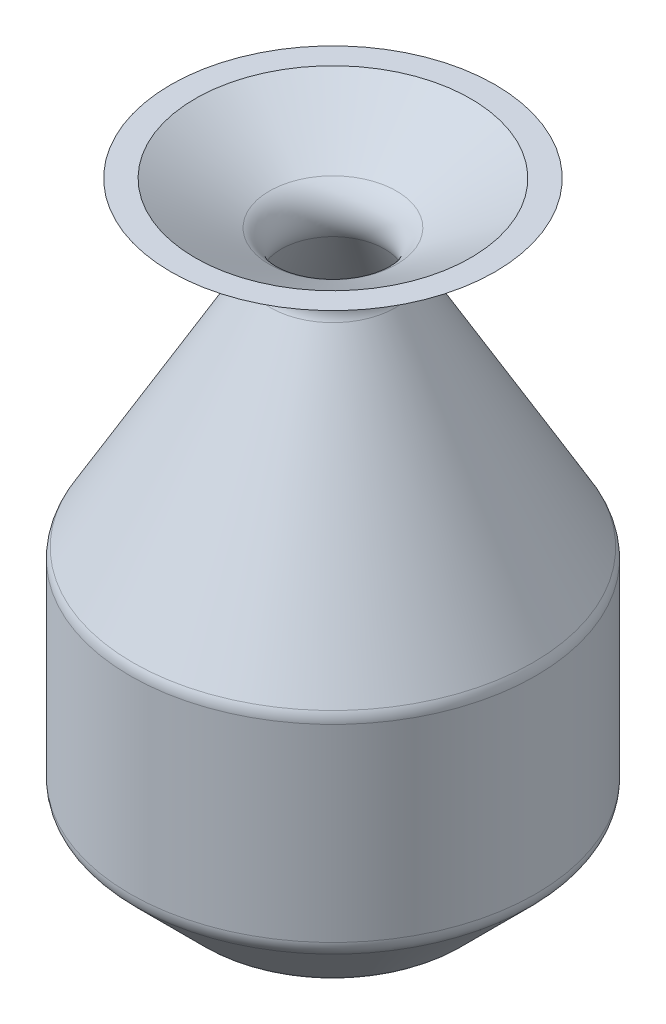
ISO-10303-21;
HEADER;
FILE_DESCRIPTION(('STEP AP214'),'2;1');
FILE_NAME('part.step','',(''),(''),'','','');
FILE_SCHEMA(('AUTOMOTIVE_DESIGN { 1 0 10303 214 1 1 1 1 }'));
ENDSEC;
DATA;
#1=APPLICATION_CONTEXT('core data for automotive mechanical design processes');
#2=APPLICATION_PROTOCOL_DEFINITION('international standard','automotive_design',2000,#1);
#3=PRODUCT_CONTEXT('',#1,'mechanical');
#4=PRODUCT('Part','Part','',(#3));
#5=PRODUCT_RELATED_PRODUCT_CATEGORY('part','',(#4));
#6=PRODUCT_DEFINITION_FORMATION('','',#4);
#7=PRODUCT_DEFINITION_CONTEXT('part definition',#1,'design');
#8=PRODUCT_DEFINITION('design','',#6,#7);
#9=PRODUCT_DEFINITION_SHAPE('','',#8);
#10=(LENGTH_UNIT() NAMED_UNIT(*) SI_UNIT(.MILLI.,.METRE.));
#11=(NAMED_UNIT(*) PLANE_ANGLE_UNIT() SI_UNIT($,.RADIAN.));
#12=(NAMED_UNIT(*) SI_UNIT($,.STERADIAN.) SOLID_ANGLE_UNIT());
#13=UNCERTAINTY_MEASURE_WITH_UNIT(LENGTH_MEASURE(1.E-05),#10,'distance_accuracy_value','');
#14=(GEOMETRIC_REPRESENTATION_CONTEXT(3) GLOBAL_UNCERTAINTY_ASSIGNED_CONTEXT((#13)) GLOBAL_UNIT_ASSIGNED_CONTEXT((#10,
#11,#12)) REPRESENTATION_CONTEXT('',''));
#15=CARTESIAN_POINT('',(0.,0.,0.));
#16=DIRECTION('',(0.,0.,1.));
#17=DIRECTION('',(1.,0.,0.));
#18=AXIS2_PLACEMENT_3D('',#15,#16,#17);
#19=CARTESIAN_POINT('',(0.,0.,0.));
#20=DIRECTION('',(0.,-1.,0.));
#21=DIRECTION('',(0.,0.,-1.));
#22=AXIS2_PLACEMENT_3D('',#19,#20,#21);
#23=PLANE('',#22);
#24=CARTESIAN_POINT('',(0.,0.,0.));
#25=DIRECTION('',(0.,1.,0.));
#26=DIRECTION('',(0.,0.,1.));
#27=AXIS2_PLACEMENT_3D('',#24,#25,#26);
#28=CIRCLE('',#27,27.9289321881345);
#29=CARTESIAN_POINT('',(0.,0.,27.9289321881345));
#30=VERTEX_POINT('',#29);
#31=EDGE_CURVE('E10',#30,#30,#28,.T.);
#32=ORIENTED_EDGE('',*,*,#31,.F.);
#33=EDGE_LOOP('',(#32));
#34=FACE_BOUND('',#33,.T.);
#35=ADVANCED_FACE('F30',(#34),#23,.T.);
#36=CARTESIAN_POINT('',(0.,5.,0.));
#37=DIRECTION('',(0.,1.,0.));
#38=DIRECTION('',(0.,0.,1.));
#39=AXIS2_PLACEMENT_3D('',#36,#37,#38);
#40=TOROIDAL_SURFACE('',#39,27.9289321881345,5.);
#41=ORIENTED_EDGE('',*,*,#31,.T.);
#42=EDGE_LOOP('',(#41));
#43=FACE_BOUND('',#42,.T.);
#44=CARTESIAN_POINT('',(0.,1.46446609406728,0.));
#45=DIRECTION('',(0.,1.,0.));
#46=DIRECTION('',(0.,0.,1.));
#47=AXIS2_PLACEMENT_3D('',#44,#45,#46);
#48=CIRCLE('',#47,31.4644660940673);
#49=CARTESIAN_POINT('',(0.,1.46446609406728,31.4644660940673));
#50=VERTEX_POINT('',#49);
#51=EDGE_CURVE('E36',#50,#50,#48,.T.);
#52=ORIENTED_EDGE('',*,*,#51,.F.);
#53=EDGE_LOOP('',(#52));
#54=FACE_BOUND('',#53,.T.);
#55=ADVANCED_FACE('F160',(#43,#54),#40,.T.);
#56=CARTESIAN_POINT('',(0.,18.5355339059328,0.));
#57=DIRECTION('',(0.,1.,0.));
#58=DIRECTION('',(0.,0.,1.));
#59=AXIS2_PLACEMENT_3D('',#56,#57,#58);
#60=CONICAL_SURFACE('',#59,48.5355339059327,0.785398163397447);
#61=ORIENTED_EDGE('',*,*,#51,.T.);
#62=EDGE_LOOP('',(#61));
#63=FACE_BOUND('',#62,.T.);
#64=CARTESIAN_POINT('',(0.,18.5355339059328,0.));
#65=DIRECTION('',(0.,1.,0.));
#66=DIRECTION('',(0.,0.,1.));
#67=AXIS2_PLACEMENT_3D('',#64,#65,#66);
#68=CIRCLE('',#67,48.5355339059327);
#69=CARTESIAN_POINT('',(0.,18.5355339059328,48.5355339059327));
#70=VERTEX_POINT('',#69);
#71=EDGE_CURVE('E40',#70,#70,#68,.T.);
#72=ORIENTED_EDGE('',*,*,#71,.F.);
#73=EDGE_LOOP('',(#72));
#74=FACE_BOUND('',#73,.T.);
#75=ADVANCED_FACE('F165',(#63,#74),#60,.T.);
#76=CARTESIAN_POINT('',(0.,22.0710678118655,0.));
#77=DIRECTION('',(0.,1.,0.));
#78=DIRECTION('',(0.,0.,1.));
#79=AXIS2_PLACEMENT_3D('',#76,#77,#78);
#80=TOROIDAL_SURFACE('',#79,45.,5.);
#81=ORIENTED_EDGE('',*,*,#71,.T.);
#82=EDGE_LOOP('',(#81));
#83=FACE_BOUND('',#82,.T.);
#84=CARTESIAN_POINT('',(0.,22.0710678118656,0.));
#85=DIRECTION('',(0.,1.,0.));
#86=DIRECTION('',(0.,0.,1.));
#87=AXIS2_PLACEMENT_3D('',#84,#85,#86);
#88=CIRCLE('',#87,50.);
#89=CARTESIAN_POINT('',(0.,22.0710678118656,50.));
#90=VERTEX_POINT('',#89);
#91=EDGE_CURVE('E44',#90,#90,#88,.T.);
#92=ORIENTED_EDGE('',*,*,#91,.F.);
#93=EDGE_LOOP('',(#92));
#94=FACE_BOUND('',#93,.T.);
#95=ADVANCED_FACE('F169',(#83,#94),#80,.T.);
#96=CARTESIAN_POINT('',(0.,198.025252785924,0.));
#97=DIRECTION('',(0.,1.,0.));
#98=DIRECTION('',(0.,0.,1.));
#99=AXIS2_PLACEMENT_3D('',#96,#97,#98);
#100=CYLINDRICAL_SURFACE('',#99,50.);
#101=ORIENTED_EDGE('',*,*,#91,.T.);
#102=EDGE_LOOP('',(#101));
#103=FACE_BOUND('',#102,.T.);
#104=CARTESIAN_POINT('',(0.,68.6602540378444,0.));
#105=DIRECTION('',(0.,1.,0.));
#106=DIRECTION('',(0.,0.,1.));
#107=AXIS2_PLACEMENT_3D('',#104,#105,#106);
#108=CIRCLE('',#107,50.);
#109=CARTESIAN_POINT('',(0.,68.6602540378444,50.));
#110=VERTEX_POINT('',#109);
#111=EDGE_CURVE('E49',#110,#110,#108,.T.);
#112=ORIENTED_EDGE('',*,*,#111,.F.);
#113=EDGE_LOOP('',(#112));
#114=FACE_BOUND('',#113,.T.);
#115=ADVANCED_FACE('F175',(#103,#114),#100,.T.);
#116=CARTESIAN_POINT('',(0.,68.6602540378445,0.));
#117=DIRECTION('',(0.,1.,0.));
#118=DIRECTION('',(0.,0.,1.));
#119=AXIS2_PLACEMENT_3D('',#116,#117,#118);
#120=TOROIDAL_SURFACE('',#119,45.,5.);
#121=ORIENTED_EDGE('',*,*,#111,.T.);
#122=EDGE_LOOP('',(#121));
#123=FACE_BOUND('',#122,.T.);
#124=CARTESIAN_POINT('',(0.,71.1602540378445,0.));
#125=DIRECTION('',(0.,1.,0.));
#126=DIRECTION('',(0.,0.,1.));
#127=AXIS2_PLACEMENT_3D('',#124,#125,#126);
#128=CIRCLE('',#127,49.3301270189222);
#129=CARTESIAN_POINT('',(0.,71.1602540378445,-49.3301270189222));
#130=VERTEX_POINT('',#129);
#131=EDGE_CURVE('E52',#130,#130,#128,.T.);
#132=ORIENTED_EDGE('',*,*,#131,.F.);
#133=EDGE_LOOP('',(#132));
#134=FACE_BOUND('',#133,.T.);
#135=ADVANCED_FACE('F179',(#123,#134),#120,.T.);
#136=CARTESIAN_POINT('',(0.,130.,0.));
#137=DIRECTION('',(0.,-1.,0.));
#138=DIRECTION('',(0.,0.,-1.));
#139=AXIS2_PLACEMENT_3D('',#136,#137,#138);
#140=CONICAL_SURFACE('',#139,15.3589838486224,0.5235987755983);
#141=CARTESIAN_POINT('',(0.,130.,0.));
#142=DIRECTION('',(0.,1.,0.));
#143=DIRECTION('',(0.,0.,1.));
#144=AXIS2_PLACEMENT_3D('',#141,#142,#143);
#145=CIRCLE('',#144,15.3589838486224);
#146=CARTESIAN_POINT('',(0.,130.,-15.3589838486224));
#147=VERTEX_POINT('',#146);
#148=EDGE_CURVE('E55',#147,#147,#145,.T.);
#149=CARTESIAN_POINT('',(0.,71.1602540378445,-49.3301270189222));
#150=CARTESIAN_POINT('',(0.,71.7731680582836,-48.9762609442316));
#151=CARTESIAN_POINT('',(0.,72.3860820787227,-48.6223948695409));
#152=CARTESIAN_POINT('',(0.,73.6119101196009,-47.9146627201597));
#153=CARTESIAN_POINT('',(0.,74.2248241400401,-47.5607966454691));
#154=CARTESIAN_POINT('',(0.,75.4506521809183,-46.8530644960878));
#155=CARTESIAN_POINT('',(0.,76.0635662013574,-46.4991984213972));
#156=CARTESIAN_POINT('',(0.,77.2893942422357,-45.791466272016));
#157=CARTESIAN_POINT('',(0.,77.9023082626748,-45.4376001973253));
#158=CARTESIAN_POINT('',(0.,79.128136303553,-44.7298680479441));
#159=CARTESIAN_POINT('',(0.,79.7410503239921,-44.3760019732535));
#160=CARTESIAN_POINT('',(0.,80.9668783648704,-43.6682698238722));
#161=CARTESIAN_POINT('',(0.,81.5797923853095,-43.3144037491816));
#162=CARTESIAN_POINT('',(0.,82.8056204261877,-42.6066715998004));
#163=CARTESIAN_POINT('',(0.,83.4185344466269,-42.2528055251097));
#164=CARTESIAN_POINT('',(0.,84.6443624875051,-41.5450733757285));
#165=CARTESIAN_POINT('',(0.,85.2572765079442,-41.1912073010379));
#166=CARTESIAN_POINT('',(0.,86.4831045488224,-40.4834751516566));
#167=CARTESIAN_POINT('',(0.,87.0960185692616,-40.129609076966));
#168=CARTESIAN_POINT('',(0.,88.3218466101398,-39.4218769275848));
#169=CARTESIAN_POINT('',(0.,88.9347606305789,-39.0680108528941));
#170=CARTESIAN_POINT('',(0.,90.1605886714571,-38.3602787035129));
#171=CARTESIAN_POINT('',(0.,90.7735026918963,-38.0064126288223));
#172=CARTESIAN_POINT('',(0.,91.9993307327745,-37.298680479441));
#173=CARTESIAN_POINT('',(0.,92.6122447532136,-36.9448144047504));
#174=CARTESIAN_POINT('',(0.,93.8380727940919,-36.2370822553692));
#175=CARTESIAN_POINT('',(0.,94.450986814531,-35.8832161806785));
#176=CARTESIAN_POINT('',(0.,95.6768148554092,-35.1754840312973));
#177=CARTESIAN_POINT('',(0.,96.2897288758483,-34.8216179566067));
#178=CARTESIAN_POINT('',(0.,97.5155569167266,-34.1138858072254));
#179=CARTESIAN_POINT('',(0.,98.1284709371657,-33.7600197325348));
#180=CARTESIAN_POINT('',(0.,99.3542989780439,-33.0522875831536));
#181=CARTESIAN_POINT('',(0.,99.9672129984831,-32.6984215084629));
#182=CARTESIAN_POINT('',(0.,101.193041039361,-31.9906893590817));
#183=CARTESIAN_POINT('',(0.,101.8059550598,-31.6368232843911));
#184=CARTESIAN_POINT('',(0.,103.031783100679,-30.9290911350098));
#185=CARTESIAN_POINT('',(0.,103.644697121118,-30.5752250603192));
#186=CARTESIAN_POINT('',(0.,104.870525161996,-29.867492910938));
#187=CARTESIAN_POINT('',(0.,105.483439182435,-29.5136268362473));
#188=CARTESIAN_POINT('',(0.,106.709267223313,-28.8058946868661));
#189=CARTESIAN_POINT('',(0.,107.322181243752,-28.4520286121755));
#190=CARTESIAN_POINT('',(0.,108.548009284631,-27.7442964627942));
#191=CARTESIAN_POINT('',(0.,109.16092330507,-27.3904303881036));
#192=CARTESIAN_POINT('',(0.,110.386751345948,-26.6826982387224));
#193=CARTESIAN_POINT('',(0.,110.999665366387,-26.3288321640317));
#194=CARTESIAN_POINT('',(0.,112.225493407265,-25.6211000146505));
#195=CARTESIAN_POINT('',(0.,112.838407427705,-25.2672339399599));
#196=CARTESIAN_POINT('',(0.,114.064235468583,-24.5595017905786));
#197=CARTESIAN_POINT('',(0.,114.677149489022,-24.205635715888));
#198=CARTESIAN_POINT('',(0.,115.9029775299,-23.4979035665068));
#199=CARTESIAN_POINT('',(0.,116.515891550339,-23.1440374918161));
#200=CARTESIAN_POINT('',(0.,117.741719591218,-22.4363053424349));
#201=CARTESIAN_POINT('',(0.,118.354633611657,-22.0824392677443));
#202=CARTESIAN_POINT('',(0.,119.580461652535,-21.374707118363));
#203=CARTESIAN_POINT('',(0.,120.193375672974,-21.0208410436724));
#204=CARTESIAN_POINT('',(0.,121.419203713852,-20.3131088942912));
#205=CARTESIAN_POINT('',(0.,122.032117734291,-19.9592428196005));
#206=CARTESIAN_POINT('',(0.,123.25794577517,-19.2515106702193));
#207=CARTESIAN_POINT('',(0.,123.870859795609,-18.8976445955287));
#208=CARTESIAN_POINT('',(0.,125.096687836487,-18.1899124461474));
#209=CARTESIAN_POINT('',(0.,125.709601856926,-17.8360463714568));
#210=CARTESIAN_POINT('',(0.,126.935429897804,-17.1283142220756));
#211=CARTESIAN_POINT('',(0.,127.548343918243,-16.7744481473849));
#212=CARTESIAN_POINT('',(0.,128.774171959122,-16.0667159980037));
#213=CARTESIAN_POINT('',(0.,129.387085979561,-15.7128499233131));
#214=CARTESIAN_POINT('',(0.,130.,-15.3589838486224));
#215=B_SPLINE_CURVE_WITH_KNOTS('',3,(#149,#150,#151,#152,#153,#154,#155,#156,#157,#158,#159,
#160,#161,#162,#163,#164,#165,#166,#167,#168,#169,#170,#171,#172,#173,#174,#175,#176,#177,#178,
#179,#180,#181,#182,#183,#184,#185,#186,#187,#188,#189,#190,#191,#192,#193,#194,#195,#196,#197,
#198,#199,#200,#201,#202,#203,#204,#205,#206,#207,#208,#209,#210,#211,#212,#213,#214),
.UNSPECIFIED.,.F.,.F.,(4,2,2,2,2,2,2,2,2,2,2,2,2,2,2,2,2,2,2,2,2,2,2,2,2,2,2,2,2,2,2,2,4),(0.,
2.12319644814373,4.24639289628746,6.36958934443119,8.49278579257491,10.6159822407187,
12.7391786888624,14.8623751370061,16.9855715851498,19.1087680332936,21.2319644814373,
23.355160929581,25.4783573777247,27.6015538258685,29.7247502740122,31.8479467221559,
33.9711431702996,36.0943396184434,38.2175360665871,40.3407325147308,42.4639289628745,
44.5871254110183,46.710321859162,48.8335183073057,50.9567147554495,53.0799112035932,
55.2031076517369,57.3263040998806,59.4495005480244,61.5726969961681,63.6958934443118,
65.8190898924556,67.9422863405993),.UNSPECIFIED.);
#216=EDGE_CURVE('BSEAM156',#130,#147,#215,.T.);
#217=ORIENTED_EDGE('',*,*,#131,.T.);
#218=ORIENTED_EDGE('',*,*,#148,.F.);
#219=ORIENTED_EDGE('',*,*,#216,.T.);
#220=ORIENTED_EDGE('',*,*,#216,.F.);
#221=EDGE_LOOP('',(#217,#219,#218,#220));
#222=FACE_BOUND('',#221,.T.);
#223=ADVANCED_FACE('F156',(#222),#140,.T.);
#224=CARTESIAN_POINT('',(0.,132.5,0.));
#225=DIRECTION('',(0.,1.,0.));
#226=DIRECTION('',(0.,0.,1.));
#227=AXIS2_PLACEMENT_3D('',#224,#225,#226);
#228=TOROIDAL_SURFACE('',#227,19.6891108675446,5.);
#229=ORIENTED_EDGE('',*,*,#148,.T.);
#230=EDGE_LOOP('',(#229));
#231=FACE_BOUND('',#230,.T.);
#232=CARTESIAN_POINT('',(0.,136.830127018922,0.));
#233=DIRECTION('',(0.,1.,0.));
#234=DIRECTION('',(0.,0.,1.));
#235=AXIS2_PLACEMENT_3D('',#232,#233,#234);
#236=CIRCLE('',#235,17.1891108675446);
#237=CARTESIAN_POINT('',(0.,136.830127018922,17.1891108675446));
#238=VERTEX_POINT('',#237);
#239=EDGE_CURVE('E58',#238,#238,#236,.T.);
#240=ORIENTED_EDGE('',*,*,#239,.F.);
#241=EDGE_LOOP('',(#240));
#242=FACE_BOUND('',#241,.T.);
#243=ADVANCED_FACE('F150',(#231,#242),#228,.F.);
#244=CARTESIAN_POINT('',(0.,150.,0.));
#245=DIRECTION('',(0.,1.,0.));
#246=DIRECTION('',(0.,0.,1.));
#247=AXIS2_PLACEMENT_3D('',#244,#245,#246);
#248=CONICAL_SURFACE('',#247,40.,1.0471975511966);
#249=ORIENTED_EDGE('',*,*,#239,.T.);
#250=EDGE_LOOP('',(#249));
#251=FACE_BOUND('',#250,.T.);
#252=CARTESIAN_POINT('',(0.,150.,0.));
#253=DIRECTION('',(0.,1.,0.));
#254=DIRECTION('',(0.,0.,1.));
#255=AXIS2_PLACEMENT_3D('',#252,#253,#254);
#256=CIRCLE('',#255,40.);
#257=CARTESIAN_POINT('',(0.,150.,40.));
#258=VERTEX_POINT('',#257);
#259=EDGE_CURVE('E61',#258,#258,#256,.T.);
#260=ORIENTED_EDGE('',*,*,#259,.F.);
#261=EDGE_LOOP('',(#260));
#262=FACE_BOUND('',#261,.T.);
#263=ADVANCED_FACE('F145',(#251,#262),#248,.T.);
#264=CARTESIAN_POINT('',(-40.,150.,0.));
#265=DIRECTION('',(0.,1.,0.));
#266=DIRECTION('',(0.,0.,1.));
#267=AXIS2_PLACEMENT_3D('',#264,#265,#266);
#268=PLANE('',#267);
#269=CARTESIAN_POINT('',(0.,150.,0.));
#270=DIRECTION('',(0.,1.,0.));
#271=DIRECTION('',(0.,0.,1.));
#272=AXIS2_PLACEMENT_3D('',#269,#270,#271);
#273=CIRCLE('',#272,34.);
#274=CARTESIAN_POINT('',(0.,150.,34.));
#275=VERTEX_POINT('',#274);
#276=EDGE_CURVE('E65',#275,#275,#273,.T.);
#277=ORIENTED_EDGE('',*,*,#276,.F.);
#278=EDGE_LOOP('',(#277));
#279=FACE_BOUND('',#278,.T.);
#280=ORIENTED_EDGE('',*,*,#259,.T.);
#281=EDGE_LOOP('',(#280));
#282=FACE_BOUND('',#281,.T.);
#283=ADVANCED_FACE('F142',(#279,#282),#268,.T.);
#284=CARTESIAN_POINT('',(0.,3.,0.));
#285=DIRECTION('',(0.,-1.,0.));
#286=DIRECTION('',(0.,0.,-1.));
#287=AXIS2_PLACEMENT_3D('',#284,#285,#286);
#288=PLANE('',#287);
#289=CARTESIAN_POINT('',(0.,3.,0.));
#290=DIRECTION('',(0.,1.,0.));
#291=DIRECTION('',(0.,0.,1.));
#292=AXIS2_PLACEMENT_3D('',#289,#290,#291);
#293=CIRCLE('',#292,27.9289321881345);
#294=CARTESIAN_POINT('',(0.,3.,27.9289321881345));
#295=VERTEX_POINT('',#294);
#296=EDGE_CURVE('E64',#295,#295,#293,.T.);
#297=ORIENTED_EDGE('',*,*,#296,.T.);
#298=EDGE_LOOP('',(#297));
#299=FACE_BOUND('',#298,.T.);
#300=ADVANCED_FACE('F92',(#299),#288,.F.);
#301=CARTESIAN_POINT('',(0.,5.,0.));
#302=DIRECTION('',(0.,1.,0.));
#303=DIRECTION('',(0.,0.,1.));
#304=AXIS2_PLACEMENT_3D('',#301,#302,#303);
#305=TOROIDAL_SURFACE('',#304,27.9289321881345,2.);
#306=ORIENTED_EDGE('',*,*,#296,.F.);
#307=EDGE_LOOP('',(#306));
#308=FACE_BOUND('',#307,.T.);
#309=CARTESIAN_POINT('',(0.,3.58578643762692,0.));
#310=DIRECTION('',(0.,1.,0.));
#311=DIRECTION('',(0.,0.,1.));
#312=AXIS2_PLACEMENT_3D('',#309,#310,#311);
#313=CIRCLE('',#312,29.3431457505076);
#314=CARTESIAN_POINT('',(0.,3.58578643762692,29.3431457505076));
#315=VERTEX_POINT('',#314);
#316=EDGE_CURVE('E86',#315,#315,#313,.T.);
#317=ORIENTED_EDGE('',*,*,#316,.T.);
#318=EDGE_LOOP('',(#317));
#319=FACE_BOUND('',#318,.T.);
#320=ADVANCED_FACE('F94',(#308,#319),#305,.F.);
#321=CARTESIAN_POINT('',(0.,20.6568542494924,0.));
#322=DIRECTION('',(0.,1.,0.));
#323=DIRECTION('',(0.,0.,1.));
#324=AXIS2_PLACEMENT_3D('',#321,#322,#323);
#325=CONICAL_SURFACE('',#324,46.4142135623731,0.785398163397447);
#326=ORIENTED_EDGE('',*,*,#316,.F.);
#327=EDGE_LOOP('',(#326));
#328=FACE_BOUND('',#327,.T.);
#329=CARTESIAN_POINT('',(0.,20.6568542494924,0.));
#330=DIRECTION('',(0.,1.,0.));
#331=DIRECTION('',(0.,0.,1.));
#332=AXIS2_PLACEMENT_3D('',#329,#330,#331);
#333=CIRCLE('',#332,46.4142135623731);
#334=CARTESIAN_POINT('',(0.,20.6568542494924,46.4142135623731));
#335=VERTEX_POINT('',#334);
#336=EDGE_CURVE('E83',#335,#335,#333,.T.);
#337=ORIENTED_EDGE('',*,*,#336,.T.);
#338=EDGE_LOOP('',(#337));
#339=FACE_BOUND('',#338,.T.);
#340=ADVANCED_FACE('F97',(#328,#339),#325,.F.);
#341=CARTESIAN_POINT('',(0.,22.0710678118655,0.));
#342=DIRECTION('',(0.,1.,0.));
#343=DIRECTION('',(0.,0.,1.));
#344=AXIS2_PLACEMENT_3D('',#341,#342,#343);
#345=TOROIDAL_SURFACE('',#344,45.,2.);
#346=ORIENTED_EDGE('',*,*,#336,.F.);
#347=EDGE_LOOP('',(#346));
#348=FACE_BOUND('',#347,.T.);
#349=CARTESIAN_POINT('',(0.,22.0710678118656,0.));
#350=DIRECTION('',(0.,1.,0.));
#351=DIRECTION('',(0.,0.,1.));
#352=AXIS2_PLACEMENT_3D('',#349,#350,#351);
#353=CIRCLE('',#352,47.);
#354=CARTESIAN_POINT('',(0.,22.0710678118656,47.));
#355=VERTEX_POINT('',#354);
#356=EDGE_CURVE('E80',#355,#355,#353,.T.);
#357=ORIENTED_EDGE('',*,*,#356,.T.);
#358=EDGE_LOOP('',(#357));
#359=FACE_BOUND('',#358,.T.);
#360=ADVANCED_FACE('F103',(#348,#359),#345,.F.);
#361=CARTESIAN_POINT('',(0.,198.025252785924,0.));
#362=DIRECTION('',(0.,1.,0.));
#363=DIRECTION('',(0.,0.,1.));
#364=AXIS2_PLACEMENT_3D('',#361,#362,#363);
#365=CYLINDRICAL_SURFACE('',#364,47.);
#366=ORIENTED_EDGE('',*,*,#356,.F.);
#367=EDGE_LOOP('',(#366));
#368=FACE_BOUND('',#367,.T.);
#369=CARTESIAN_POINT('',(0.,68.6602540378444,0.));
#370=DIRECTION('',(0.,1.,0.));
#371=DIRECTION('',(0.,0.,1.));
#372=AXIS2_PLACEMENT_3D('',#369,#370,#371);
#373=CIRCLE('',#372,47.);
#374=CARTESIAN_POINT('',(0.,68.6602540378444,47.));
#375=VERTEX_POINT('',#374);
#376=EDGE_CURVE('E77',#375,#375,#373,.T.);
#377=ORIENTED_EDGE('',*,*,#376,.T.);
#378=EDGE_LOOP('',(#377));
#379=FACE_BOUND('',#378,.T.);
#380=ADVANCED_FACE('F109',(#368,#379),#365,.F.);
#381=CARTESIAN_POINT('',(0.,68.6602540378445,0.));
#382=DIRECTION('',(0.,1.,0.));
#383=DIRECTION('',(0.,0.,1.));
#384=AXIS2_PLACEMENT_3D('',#381,#382,#383);
#385=TOROIDAL_SURFACE('',#384,45.,2.);
#386=ORIENTED_EDGE('',*,*,#376,.F.);
#387=EDGE_LOOP('',(#386));
#388=FACE_BOUND('',#387,.T.);
#389=CARTESIAN_POINT('',(0.,69.6602540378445,0.));
#390=DIRECTION('',(0.,-1.,0.));
#391=DIRECTION('',(0.,0.,-1.));
#392=AXIS2_PLACEMENT_3D('',#389,#390,#391);
#393=CIRCLE('',#392,46.7320508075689);
#394=CARTESIAN_POINT('',(0.,69.6602540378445,-46.7320508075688));
#395=VERTEX_POINT('',#394);
#396=EDGE_CURVE('E74',#395,#395,#393,.F.);
#397=ORIENTED_EDGE('',*,*,#396,.T.);
#398=EDGE_LOOP('',(#397));
#399=FACE_BOUND('',#398,.T.);
#400=ADVANCED_FACE('F115',(#388,#399),#385,.F.);
#401=CARTESIAN_POINT('',(0.,128.5,0.));
#402=DIRECTION('',(0.,-1.,0.));
#403=DIRECTION('',(0.,0.,-1.));
#404=AXIS2_PLACEMENT_3D('',#401,#402,#403);
#405=CONICAL_SURFACE('',#404,12.7609076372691,0.5235987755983);
#406=CARTESIAN_POINT('',(0.,128.5,0.));
#407=DIRECTION('',(0.,1.,0.));
#408=DIRECTION('',(0.,0.,1.));
#409=AXIS2_PLACEMENT_3D('',#406,#407,#408);
#410=CIRCLE('',#409,12.7609076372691);
#411=CARTESIAN_POINT('',(0.,128.5,-12.7609076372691));
#412=VERTEX_POINT('',#411);
#413=EDGE_CURVE('E71',#412,#412,#410,.T.);
#414=CARTESIAN_POINT('',(0.,69.6602540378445,-46.7320508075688));
#415=CARTESIAN_POINT('',(0.,70.2731680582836,-46.3781847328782));
#416=CARTESIAN_POINT('',(0.,70.8860820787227,-46.0243186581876));
#417=CARTESIAN_POINT('',(0.,72.111910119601,-45.3165865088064));
#418=CARTESIAN_POINT('',(0.,72.7248241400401,-44.9627204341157));
#419=CARTESIAN_POINT('',(0.,73.9506521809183,-44.2549882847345));
#420=CARTESIAN_POINT('',(0.,74.5635662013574,-43.9011222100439));
#421=CARTESIAN_POINT('',(0.,75.7893942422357,-43.1933900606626));
#422=CARTESIAN_POINT('',(0.,76.4023082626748,-42.839523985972));
#423=CARTESIAN_POINT('',(0.,77.628136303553,-42.1317918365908));
#424=CARTESIAN_POINT('',(0.,78.2410503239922,-41.7779257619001));
#425=CARTESIAN_POINT('',(0.,79.4668783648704,-41.0701936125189));
#426=CARTESIAN_POINT('',(0.,80.0797923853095,-40.7163275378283));
#427=CARTESIAN_POINT('',(0.,81.3056204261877,-40.008595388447));
#428=CARTESIAN_POINT('',(0.,81.9185344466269,-39.6547293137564));
#429=CARTESIAN_POINT('',(0.,83.1443624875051,-38.9469971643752));
#430=CARTESIAN_POINT('',(0.,83.7572765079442,-38.5931310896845));
#431=CARTESIAN_POINT('',(0.,84.9831045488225,-37.8853989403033));
#432=CARTESIAN_POINT('',(0.,85.5960185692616,-37.5315328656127));
#433=CARTESIAN_POINT('',(0.,86.8218466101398,-36.8238007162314));
#434=CARTESIAN_POINT('',(0.,87.4347606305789,-36.4699346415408));
#435=CARTESIAN_POINT('',(0.,88.6605886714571,-35.7622024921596));
#436=CARTESIAN_POINT('',(0.,89.2735026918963,-35.4083364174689));
#437=CARTESIAN_POINT('',(0.,90.4993307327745,-34.7006042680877));
#438=CARTESIAN_POINT('',(0.,91.1122447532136,-34.3467381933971));
#439=CARTESIAN_POINT('',(0.,92.3380727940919,-33.6390060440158));
#440=CARTESIAN_POINT('',(0.,92.950986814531,-33.2851399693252));
#441=CARTESIAN_POINT('',(0.,94.1768148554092,-32.577407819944));
#442=CARTESIAN_POINT('',(0.,94.7897288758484,-32.2235417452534));
#443=CARTESIAN_POINT('',(0.,96.0155569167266,-31.5158095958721));
#444=CARTESIAN_POINT('',(0.,96.6284709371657,-31.1619435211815));
#445=CARTESIAN_POINT('',(0.,97.8542989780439,-30.4542113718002));
#446=CARTESIAN_POINT('',(0.,98.4672129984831,-30.1003452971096));
#447=CARTESIAN_POINT('',(0.,99.6930410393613,-29.3926131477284));
#448=CARTESIAN_POINT('',(0.,100.3059550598,-29.0387470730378));
#449=CARTESIAN_POINT('',(0.,101.531783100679,-28.3310149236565));
#450=CARTESIAN_POINT('',(0.,102.144697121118,-27.9771488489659));
#451=CARTESIAN_POINT('',(0.,103.370525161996,-27.2694166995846));
#452=CARTESIAN_POINT('',(0.,103.983439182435,-26.915550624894));
#453=CARTESIAN_POINT('',(0.,105.209267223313,-26.2078184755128));
#454=CARTESIAN_POINT('',(0.,105.822181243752,-25.8539524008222));
#455=CARTESIAN_POINT('',(0.,107.048009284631,-25.1462202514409));
#456=CARTESIAN_POINT('',(0.,107.66092330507,-24.7923541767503));
#457=CARTESIAN_POINT('',(0.,108.886751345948,-24.084622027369));
#458=CARTESIAN_POINT('',(0.,109.499665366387,-23.7307559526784));
#459=CARTESIAN_POINT('',(0.,110.725493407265,-23.0230238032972));
#460=CARTESIAN_POINT('',(0.,111.338407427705,-22.6691577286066));
#461=CARTESIAN_POINT('',(0.,112.564235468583,-21.9614255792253));
#462=CARTESIAN_POINT('',(0.,113.177149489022,-21.6075595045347));
#463=CARTESIAN_POINT('',(0.,114.4029775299,-20.8998273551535));
#464=CARTESIAN_POINT('',(0.,115.015891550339,-20.5459612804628));
#465=CARTESIAN_POINT('',(0.,116.241719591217,-19.8382291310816));
#466=CARTESIAN_POINT('',(0.,116.854633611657,-19.484363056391));
#467=CARTESIAN_POINT('',(0.,118.080461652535,-18.7766309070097));
#468=CARTESIAN_POINT('',(0.,118.693375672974,-18.4227648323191));
#469=CARTESIAN_POINT('',(0.,119.919203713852,-17.7150326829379));
#470=CARTESIAN_POINT('',(0.,120.532117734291,-17.3611666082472));
#471=CARTESIAN_POINT('',(0.,121.75794577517,-16.653434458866));
#472=CARTESIAN_POINT('',(0.,122.370859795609,-16.2995683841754));
#473=CARTESIAN_POINT('',(0.,123.596687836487,-15.5918362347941));
#474=CARTESIAN_POINT('',(0.,124.209601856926,-15.2379701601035));
#475=CARTESIAN_POINT('',(0.,125.435429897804,-14.5302380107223));
#476=CARTESIAN_POINT('',(0.,126.048343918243,-14.1763719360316));
#477=CARTESIAN_POINT('',(0.,127.274171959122,-13.4686397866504));
#478=CARTESIAN_POINT('',(0.,127.887085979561,-13.1147737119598));
#479=CARTESIAN_POINT('',(0.,128.5,-12.7609076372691));
#480=B_SPLINE_CURVE_WITH_KNOTS('',3,(#414,#415,#416,#417,#418,#419,#420,#421,#422,#423,#424,
#425,#426,#427,#428,#429,#430,#431,#432,#433,#434,#435,#436,#437,#438,#439,#440,#441,#442,#443,
#444,#445,#446,#447,#448,#449,#450,#451,#452,#453,#454,#455,#456,#457,#458,#459,#460,#461,#462,
#463,#464,#465,#466,#467,#468,#469,#470,#471,#472,#473,#474,#475,#476,#477,#478,#479),
.UNSPECIFIED.,.F.,.F.,(4,2,2,2,2,2,2,2,2,2,2,2,2,2,2,2,2,2,2,2,2,2,2,2,2,2,2,2,2,2,2,2,4),(0.,
2.12319644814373,4.24639289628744,6.36958934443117,8.4927857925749,10.6159822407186,
12.7391786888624,14.8623751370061,16.9855715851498,19.1087680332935,21.2319644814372,
23.355160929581,25.4783573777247,27.6015538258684,29.7247502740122,31.8479467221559,
33.9711431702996,36.0943396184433,38.2175360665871,40.3407325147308,42.4639289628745,
44.5871254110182,46.710321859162,48.8335183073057,50.9567147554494,53.0799112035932,
55.2031076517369,57.3263040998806,59.4495005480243,61.5726969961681,63.6958934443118,
65.8190898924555,67.9422863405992),.UNSPECIFIED.);
#481=EDGE_CURVE('BSEAM121',#395,#412,#480,.T.);
#482=ORIENTED_EDGE('',*,*,#396,.F.);
#483=ORIENTED_EDGE('',*,*,#413,.T.);
#484=ORIENTED_EDGE('',*,*,#481,.T.);
#485=ORIENTED_EDGE('',*,*,#481,.F.);
#486=EDGE_LOOP('',(#482,#484,#483,#485));
#487=FACE_BOUND('',#486,.T.);
#488=ADVANCED_FACE('F121',(#487),#405,.F.);
#489=CARTESIAN_POINT('',(0.,132.5,0.));
#490=DIRECTION('',(0.,1.,0.));
#491=DIRECTION('',(0.,0.,1.));
#492=AXIS2_PLACEMENT_3D('',#489,#490,#491);
#493=TOROIDAL_SURFACE('',#492,19.6891108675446,8.);
#494=ORIENTED_EDGE('',*,*,#413,.F.);
#495=EDGE_LOOP('',(#494));
#496=FACE_BOUND('',#495,.T.);
#497=CARTESIAN_POINT('',(0.,139.428203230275,0.));
#498=DIRECTION('',(0.,1.,0.));
#499=DIRECTION('',(0.,0.,1.));
#500=AXIS2_PLACEMENT_3D('',#497,#498,#499);
#501=CIRCLE('',#500,15.6891108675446);
#502=CARTESIAN_POINT('',(0.,139.428203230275,15.6891108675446));
#503=VERTEX_POINT('',#502);
#504=EDGE_CURVE('E68',#503,#503,#501,.T.);
#505=ORIENTED_EDGE('',*,*,#504,.T.);
#506=EDGE_LOOP('',(#505));
#507=FACE_BOUND('',#506,.T.);
#508=ADVANCED_FACE('F127',(#496,#507),#493,.T.);
#509=CARTESIAN_POINT('',(0.,152.598076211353,0.));
#510=DIRECTION('',(0.,1.,0.));
#511=DIRECTION('',(0.,0.,1.));
#512=AXIS2_PLACEMENT_3D('',#509,#510,#511);
#513=CONICAL_SURFACE('',#512,38.5,1.0471975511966);
#514=ORIENTED_EDGE('',*,*,#504,.F.);
#515=EDGE_LOOP('',(#514));
#516=FACE_BOUND('',#515,.T.);
#517=ORIENTED_EDGE('',*,*,#276,.T.);
#518=EDGE_LOOP('',(#517));
#519=FACE_BOUND('',#518,.T.);
#520=ADVANCED_FACE('F133',(#516,#519),#513,.F.);
#521=CLOSED_SHELL('',(#35,#55,#75,#95,#115,#135,#223,#243,#263,#283,#300,#320,#340,#360,#380,
#400,#488,#508,#520));
#522=MANIFOLD_SOLID_BREP('B2',#521);
#523=ADVANCED_BREP_SHAPE_REPRESENTATION('',(#18,#522),#14);
#524=SHAPE_DEFINITION_REPRESENTATION(#9,#523);
ENDSEC;
END-ISO-10303-21;
